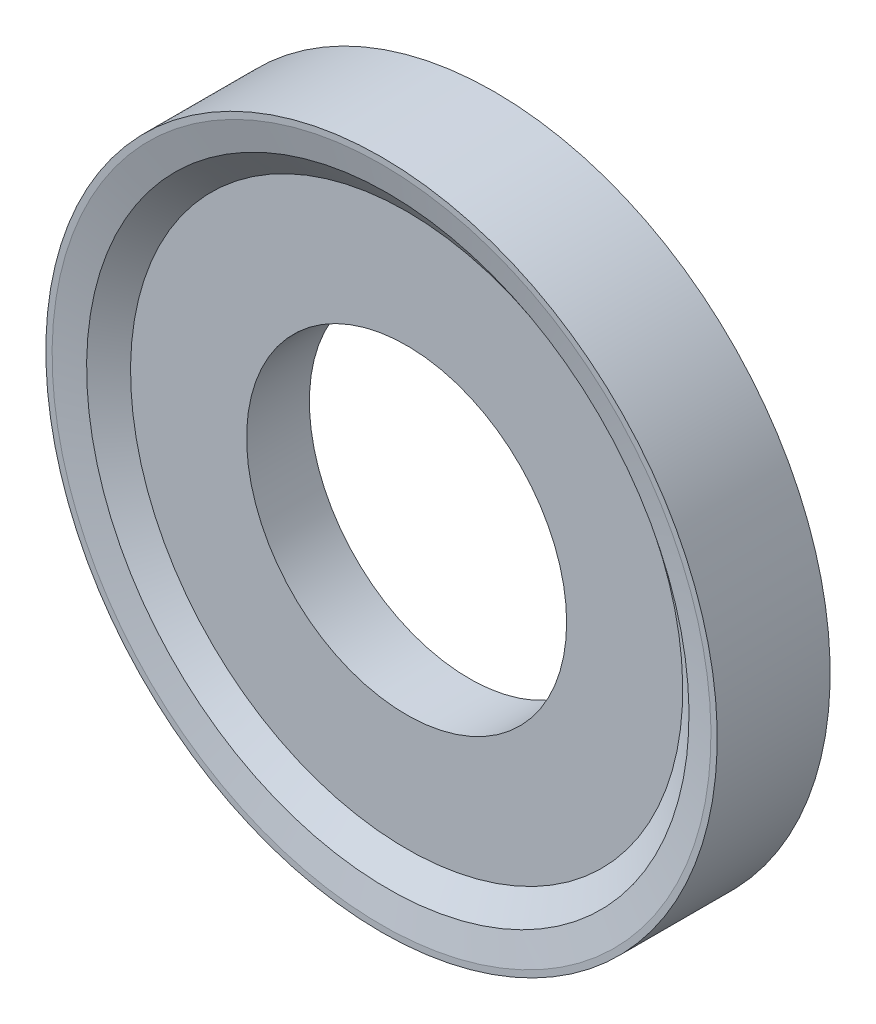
ISO-10303-21;
HEADER;
FILE_DESCRIPTION(('STEP AP214'),'2;1');
FILE_NAME('part.step','',(''),(''),'','','');
FILE_SCHEMA(('AUTOMOTIVE_DESIGN { 1 0 10303 214 1 1 1 1 }'));
ENDSEC;
DATA;
#1=APPLICATION_CONTEXT('core data for automotive mechanical design processes');
#2=APPLICATION_PROTOCOL_DEFINITION('international standard','automotive_design',2000,#1);
#3=PRODUCT_CONTEXT('',#1,'mechanical');
#4=PRODUCT('Part','Part','',(#3));
#5=PRODUCT_RELATED_PRODUCT_CATEGORY('part','',(#4));
#6=PRODUCT_DEFINITION_FORMATION('','',#4);
#7=PRODUCT_DEFINITION_CONTEXT('part definition',#1,'design');
#8=PRODUCT_DEFINITION('design','',#6,#7);
#9=PRODUCT_DEFINITION_SHAPE('','',#8);
#10=(LENGTH_UNIT() NAMED_UNIT(*) SI_UNIT(.MILLI.,.METRE.));
#11=(NAMED_UNIT(*) PLANE_ANGLE_UNIT() SI_UNIT($,.RADIAN.));
#12=(NAMED_UNIT(*) SI_UNIT($,.STERADIAN.) SOLID_ANGLE_UNIT());
#13=UNCERTAINTY_MEASURE_WITH_UNIT(LENGTH_MEASURE(1.E-05),#10,'distance_accuracy_value','');
#14=(GEOMETRIC_REPRESENTATION_CONTEXT(3) GLOBAL_UNCERTAINTY_ASSIGNED_CONTEXT((#13)) GLOBAL_UNIT_ASSIGNED_CONTEXT((#10,
#11,#12)) REPRESENTATION_CONTEXT('',''));
#15=CARTESIAN_POINT('',(0.,0.,0.));
#16=DIRECTION('',(0.,0.,1.));
#17=DIRECTION('',(1.,0.,0.));
#18=AXIS2_PLACEMENT_3D('',#15,#16,#17);
#19=CARTESIAN_POINT('',(4.4,0.,1.4));
#20=DIRECTION('',(0.,0.,1.));
#21=DIRECTION('',(0.,-1.,0.));
#22=AXIS2_PLACEMENT_3D('',#19,#20,#21);
#23=PLANE('',#22);
#24=CARTESIAN_POINT('',(0.,0.,1.4));
#25=DIRECTION('',(0.,0.,-1.));
#26=DIRECTION('',(0.,1.,0.));
#27=AXIS2_PLACEMENT_3D('',#24,#25,#26);
#28=CIRCLE('',#27,4.4);
#29=CARTESIAN_POINT('',(0.,4.4,1.4));
#30=VERTEX_POINT('',#29);
#31=EDGE_CURVE('E40',#30,#30,#28,.T.);
#32=ORIENTED_EDGE('',*,*,#31,.F.);
#33=EDGE_LOOP('',(#32));
#34=FACE_BOUND('',#33,.T.);
#35=CARTESIAN_POINT('',(0.,0.,1.4));
#36=DIRECTION('',(0.,0.,1.));
#37=DIRECTION('',(1.,0.,0.));
#38=AXIS2_PLACEMENT_3D('',#35,#36,#37);
#39=CIRCLE('',#38,2.55);
#40=CARTESIAN_POINT('',(2.55,0.,1.4));
#41=VERTEX_POINT('',#40);
#42=EDGE_CURVE('E44',#41,#41,#39,.T.);
#43=ORIENTED_EDGE('',*,*,#42,.F.);
#44=EDGE_LOOP('',(#43));
#45=FACE_BOUND('',#44,.T.);
#46=ADVANCED_FACE('F12',(#34,#45),#23,.T.);
#47=CARTESIAN_POINT('',(2.6,0.,0.4));
#48=DIRECTION('',(0.,0.,-1.));
#49=DIRECTION('',(0.,1.,0.));
#50=AXIS2_PLACEMENT_3D('',#47,#48,#49);
#51=PLANE('',#50);
#52=CARTESIAN_POINT('',(0.,0.,0.4));
#53=DIRECTION('',(0.,0.,-1.));
#54=DIRECTION('',(0.,1.,0.));
#55=AXIS2_PLACEMENT_3D('',#52,#53,#54);
#56=CIRCLE('',#55,4.4);
#57=CARTESIAN_POINT('',(0.,4.4,0.4));
#58=VERTEX_POINT('',#57);
#59=EDGE_CURVE('E8',#58,#58,#56,.T.);
#60=ORIENTED_EDGE('',*,*,#59,.T.);
#61=EDGE_LOOP('',(#60));
#62=FACE_BOUND('',#61,.T.);
#63=CARTESIAN_POINT('',(0.,0.,0.4));
#64=DIRECTION('',(0.,0.,1.));
#65=DIRECTION('',(1.,0.,0.));
#66=AXIS2_PLACEMENT_3D('',#63,#64,#65);
#67=CIRCLE('',#66,2.55);
#68=CARTESIAN_POINT('',(2.55,0.,0.4));
#69=VERTEX_POINT('',#68);
#70=EDGE_CURVE('E43',#69,#69,#67,.T.);
#71=ORIENTED_EDGE('',*,*,#70,.T.);
#72=EDGE_LOOP('',(#71));
#73=FACE_BOUND('',#72,.T.);
#74=ADVANCED_FACE('F50',(#62,#73),#51,.T.);
#75=CARTESIAN_POINT('',(0.,0.,0.4));
#76=DIRECTION('',(0.,0.,-1.));
#77=DIRECTION('',(0.,1.,0.));
#78=AXIS2_PLACEMENT_3D('',#75,#76,#77);
#79=CONICAL_SURFACE('',#78,4.4,0.927295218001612);
#80=CARTESIAN_POINT('',(0.,0.,0.1));
#81=DIRECTION('',(0.,0.,-1.));
#82=DIRECTION('',(0.,1.,0.));
#83=AXIS2_PLACEMENT_3D('',#80,#81,#82);
#84=CIRCLE('',#83,4.8);
#85=CARTESIAN_POINT('',(0.,4.8,0.1));
#86=VERTEX_POINT('',#85);
#87=EDGE_CURVE('E18',#86,#86,#84,.T.);
#88=ORIENTED_EDGE('',*,*,#87,.T.);
#89=EDGE_LOOP('',(#88));
#90=FACE_BOUND('',#89,.T.);
#91=ORIENTED_EDGE('',*,*,#59,.F.);
#92=EDGE_LOOP('',(#91));
#93=FACE_BOUND('',#92,.T.);
#94=ADVANCED_FACE('F65',(#90,#93),#79,.F.);
#95=CARTESIAN_POINT('',(0.,0.,0.1));
#96=DIRECTION('',(0.,0.,-1.));
#97=DIRECTION('',(0.,1.,0.));
#98=AXIS2_PLACEMENT_3D('',#95,#96,#97);
#99=CONICAL_SURFACE('',#98,4.8,1.35212738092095);
#100=CARTESIAN_POINT('',(0.,0.,0.));
#101=DIRECTION('',(0.,0.,-1.));
#102=DIRECTION('',(0.,1.,0.));
#103=AXIS2_PLACEMENT_3D('',#100,#101,#102);
#104=CIRCLE('',#103,5.25);
#105=CARTESIAN_POINT('',(0.,5.25,0.));
#106=VERTEX_POINT('',#105);
#107=EDGE_CURVE('E22',#106,#106,#104,.T.);
#108=ORIENTED_EDGE('',*,*,#107,.T.);
#109=EDGE_LOOP('',(#108));
#110=FACE_BOUND('',#109,.T.);
#111=ORIENTED_EDGE('',*,*,#87,.F.);
#112=EDGE_LOOP('',(#111));
#113=FACE_BOUND('',#112,.T.);
#114=ADVANCED_FACE('F94',(#110,#113),#99,.F.);
#115=CARTESIAN_POINT('',(5.25,0.,0.));
#116=DIRECTION('',(0.,0.,-1.));
#117=DIRECTION('',(0.,1.,0.));
#118=AXIS2_PLACEMENT_3D('',#115,#116,#117);
#119=PLANE('',#118);
#120=CARTESIAN_POINT('',(0.,0.,0.));
#121=DIRECTION('',(0.,0.,-1.));
#122=DIRECTION('',(0.,1.,0.));
#123=AXIS2_PLACEMENT_3D('',#120,#121,#122);
#124=CIRCLE('',#123,5.35);
#125=CARTESIAN_POINT('',(0.,5.35,0.));
#126=VERTEX_POINT('',#125);
#127=EDGE_CURVE('E26',#126,#126,#124,.T.);
#128=ORIENTED_EDGE('',*,*,#127,.T.);
#129=EDGE_LOOP('',(#128));
#130=FACE_BOUND('',#129,.T.);
#131=ORIENTED_EDGE('',*,*,#107,.F.);
#132=EDGE_LOOP('',(#131));
#133=FACE_BOUND('',#132,.T.);
#134=ADVANCED_FACE('F88',(#130,#133),#119,.T.);
#135=CARTESIAN_POINT('',(0.,0.,0.));
#136=DIRECTION('',(0.,0.,-1.));
#137=DIRECTION('',(0.,1.,0.));
#138=AXIS2_PLACEMENT_3D('',#135,#136,#137);
#139=CYLINDRICAL_SURFACE('',#138,5.35);
#140=CARTESIAN_POINT('',(0.,0.,1.8));
#141=DIRECTION('',(0.,0.,-1.));
#142=DIRECTION('',(0.,1.,0.));
#143=AXIS2_PLACEMENT_3D('',#140,#141,#142);
#144=CIRCLE('',#143,5.35);
#145=CARTESIAN_POINT('',(0.,5.35,1.8));
#146=VERTEX_POINT('',#145);
#147=EDGE_CURVE('E31',#146,#146,#144,.T.);
#148=ORIENTED_EDGE('',*,*,#147,.T.);
#149=EDGE_LOOP('',(#148));
#150=FACE_BOUND('',#149,.T.);
#151=ORIENTED_EDGE('',*,*,#127,.F.);
#152=EDGE_LOOP('',(#151));
#153=FACE_BOUND('',#152,.T.);
#154=ADVANCED_FACE('F82',(#150,#153),#139,.T.);
#155=CARTESIAN_POINT('',(5.35,0.,1.8));
#156=DIRECTION('',(0.,0.,1.));
#157=DIRECTION('',(0.,-1.,0.));
#158=AXIS2_PLACEMENT_3D('',#155,#156,#157);
#159=PLANE('',#158);
#160=CARTESIAN_POINT('',(0.,0.,1.8));
#161=DIRECTION('',(0.,0.,-1.));
#162=DIRECTION('',(0.,1.,0.));
#163=AXIS2_PLACEMENT_3D('',#160,#161,#162);
#164=CIRCLE('',#163,5.25);
#165=CARTESIAN_POINT('',(0.,5.25,1.8));
#166=VERTEX_POINT('',#165);
#167=EDGE_CURVE('E34',#166,#166,#164,.T.);
#168=ORIENTED_EDGE('',*,*,#167,.T.);
#169=EDGE_LOOP('',(#168));
#170=FACE_BOUND('',#169,.T.);
#171=ORIENTED_EDGE('',*,*,#147,.F.);
#172=EDGE_LOOP('',(#171));
#173=FACE_BOUND('',#172,.T.);
#174=ADVANCED_FACE('F76',(#170,#173),#159,.T.);
#175=CARTESIAN_POINT('',(0.,0.,1.8));
#176=DIRECTION('',(0.,0.,1.));
#177=DIRECTION('',(0.,-1.,0.));
#178=AXIS2_PLACEMENT_3D('',#175,#176,#177);
#179=CONICAL_SURFACE('',#178,5.25,1.35212738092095);
#180=CARTESIAN_POINT('',(0.,0.,1.7));
#181=DIRECTION('',(0.,0.,-1.));
#182=DIRECTION('',(0.,1.,0.));
#183=AXIS2_PLACEMENT_3D('',#180,#181,#182);
#184=CIRCLE('',#183,4.8);
#185=CARTESIAN_POINT('',(0.,4.8,1.7));
#186=VERTEX_POINT('',#185);
#187=EDGE_CURVE('E37',#186,#186,#184,.T.);
#188=ORIENTED_EDGE('',*,*,#187,.T.);
#189=EDGE_LOOP('',(#188));
#190=FACE_BOUND('',#189,.T.);
#191=ORIENTED_EDGE('',*,*,#167,.F.);
#192=EDGE_LOOP('',(#191));
#193=FACE_BOUND('',#192,.T.);
#194=ADVANCED_FACE('F70',(#190,#193),#179,.F.);
#195=CARTESIAN_POINT('',(0.,0.,1.7));
#196=DIRECTION('',(0.,0.,1.));
#197=DIRECTION('',(0.,-1.,0.));
#198=AXIS2_PLACEMENT_3D('',#195,#196,#197);
#199=CONICAL_SURFACE('',#198,4.8,0.927295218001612);
#200=ORIENTED_EDGE('',*,*,#31,.T.);
#201=EDGE_LOOP('',(#200));
#202=FACE_BOUND('',#201,.T.);
#203=ORIENTED_EDGE('',*,*,#187,.F.);
#204=EDGE_LOOP('',(#203));
#205=FACE_BOUND('',#204,.T.);
#206=ADVANCED_FACE('F55',(#202,#205),#199,.F.);
#207=CARTESIAN_POINT('',(0.,0.,0.4));
#208=DIRECTION('',(0.,0.,1.));
#209=DIRECTION('',(1.,0.,0.));
#210=AXIS2_PLACEMENT_3D('',#207,#208,#209);
#211=CYLINDRICAL_SURFACE('',#210,2.55);
#212=ORIENTED_EDGE('',*,*,#70,.F.);
#213=EDGE_LOOP('',(#212));
#214=FACE_BOUND('',#213,.T.);
#215=ORIENTED_EDGE('',*,*,#42,.T.);
#216=EDGE_LOOP('',(#215));
#217=FACE_BOUND('',#216,.T.);
#218=ADVANCED_FACE('F52',(#214,#217),#211,.F.);
#219=CLOSED_SHELL('',(#46,#74,#94,#114,#134,#154,#174,#194,#206,#218));
#220=MANIFOLD_SOLID_BREP('B1',#219);
#221=ADVANCED_BREP_SHAPE_REPRESENTATION('',(#18,#220),#14);
#222=SHAPE_DEFINITION_REPRESENTATION(#9,#221);
ENDSEC;
END-ISO-10303-21;
